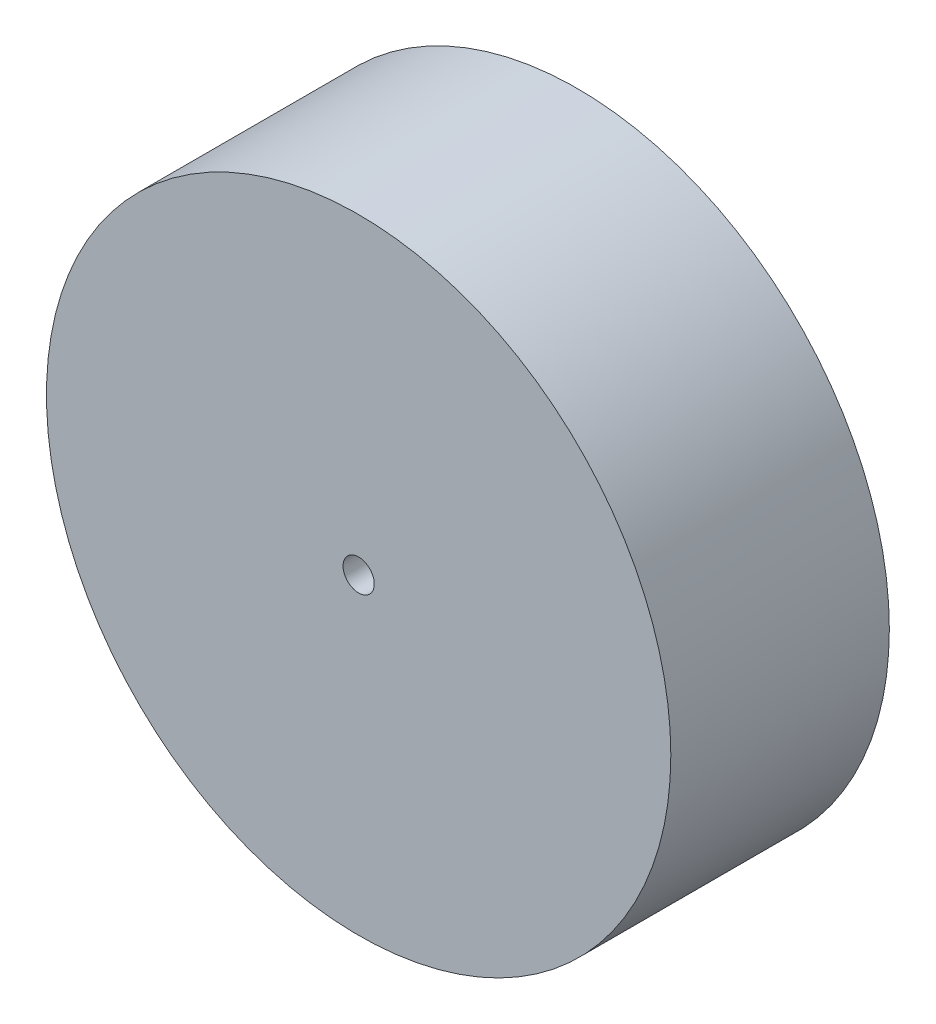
from build123d import *

# Parameters (mm, degrees)
SKETCH1_R           = 10
BOSS_EXTRUDE1_DEPTH = 30
SKETCH2_R           = 100
BOSS_EXTRUDE2_DEPTH = 70
SKETCH3_R           = 5
CUT_EXTRUDE1_DEPTH  = 110


with BuildPart() as part:
    # Sketch1 → Boss-Extrude1 (new body)
    with BuildSketch(Plane.XY):
        Circle(SKETCH1_R)
    extrude(amount=BOSS_EXTRUDE1_DEPTH)

    # Sketch2 → Boss-Extrude2 (add)
    with BuildSketch(Plane.XY.offset(30)):
        Circle(SKETCH2_R)
    extrude(amount=BOSS_EXTRUDE2_DEPTH)

    # Sketch3 → Cut-Extrude1 (cut)
    with BuildSketch(Plane(origin=(0, 0, 0), x_dir=(-1, 0, 0), z_dir=(0, 0, -1))):
        Circle(SKETCH3_R)
    extrude(amount=-CUT_EXTRUDE1_DEPTH, mode=Mode.SUBTRACT)


solid = part.part
